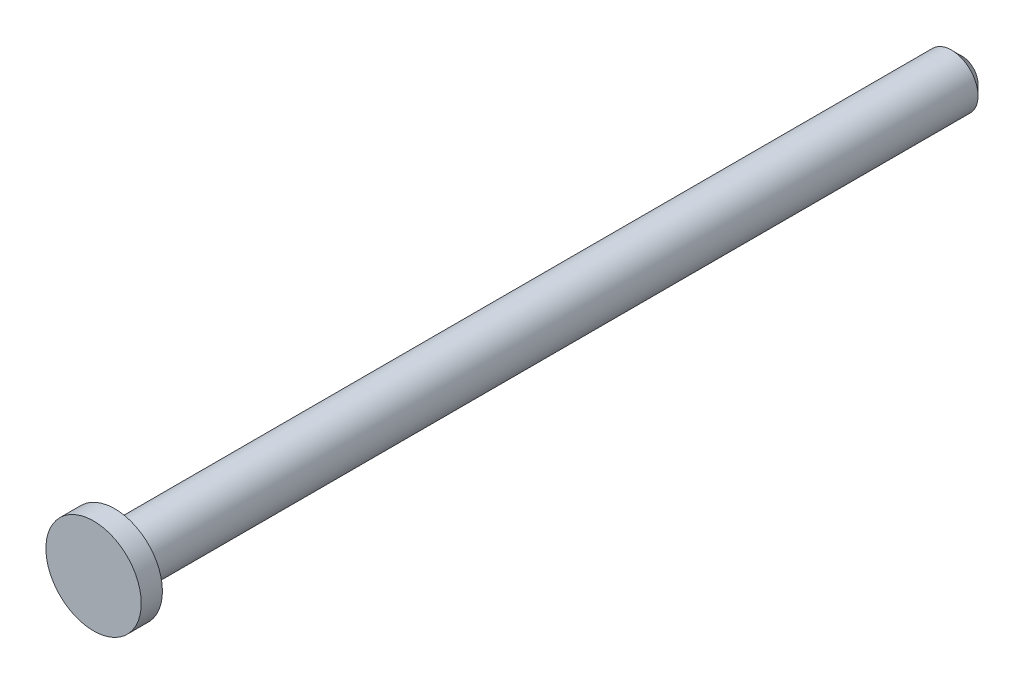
from build123d import *

# Parameters (mm, degrees)
SKETCH1_R           = 3.175
BOSS_EXTRUDE1_DEPTH = 50.8
SKETCH2_R           = 5.715
BOSS_EXTRUDE2_DEPTH = 2.54
CHAMFER1_SIZE       = 1.27


with BuildPart() as part:
    # Sketch1 → Boss-Extrude1 (new, symmetric)
    with BuildSketch(Plane.XY):
        Circle(SKETCH1_R)
    extrude(amount=BOSS_EXTRUDE1_DEPTH, both=True)

    # Sketch2 → Boss-Extrude2 (add)
    with BuildSketch(Plane.XY.offset(50.8)):
        Circle(SKETCH2_R)
    extrude(amount=BOSS_EXTRUDE2_DEPTH)

    # Chamfer1
    chamfer1_edges = [part.edges().sort_by_distance(p)[0] for p in [
        (-3.175, 0, -50.8),
    ]]
    chamfer(chamfer1_edges, length=CHAMFER1_SIZE)


solid = part.part
